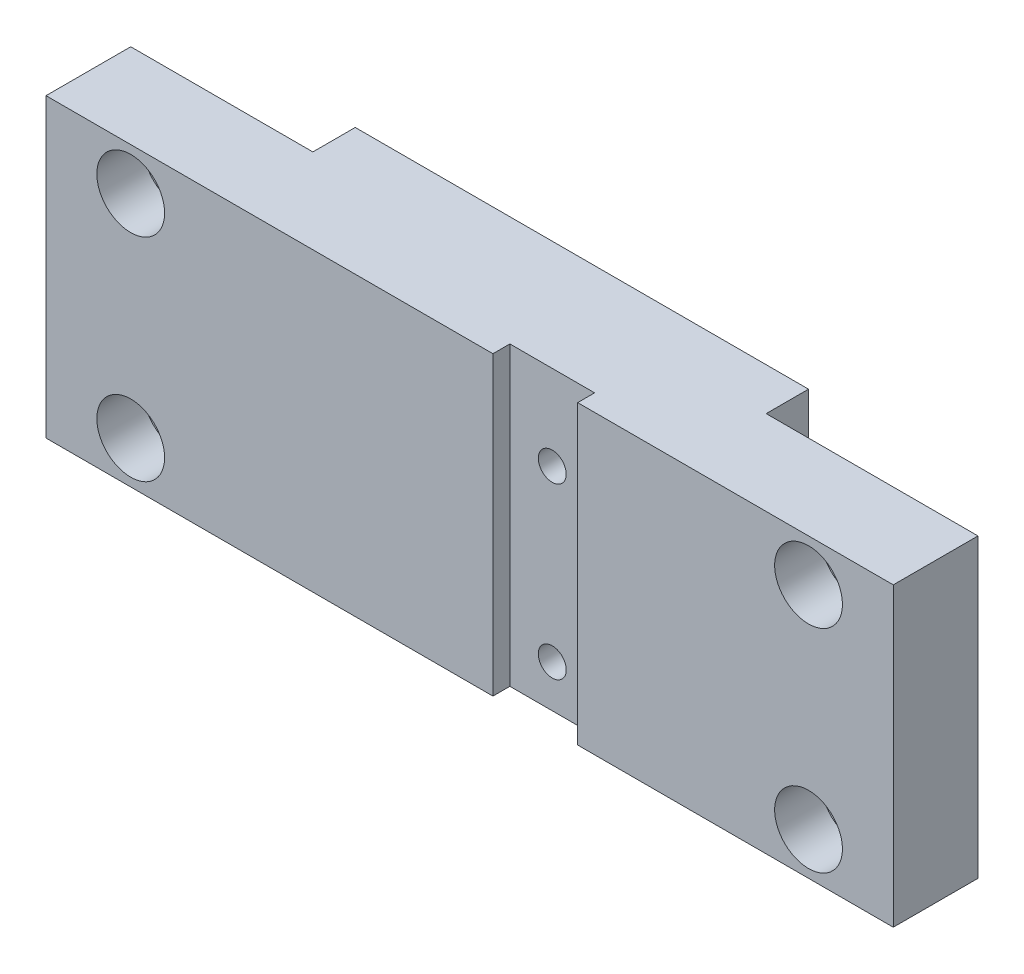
ISO-10303-21;
HEADER;
FILE_DESCRIPTION(('STEP AP214'),'2;1');
FILE_NAME('part.step','',(''),(''),'','','');
FILE_SCHEMA(('AUTOMOTIVE_DESIGN { 1 0 10303 214 1 1 1 1 }'));
ENDSEC;
DATA;
#1=APPLICATION_CONTEXT('core data for automotive mechanical design processes');
#2=APPLICATION_PROTOCOL_DEFINITION('international standard','automotive_design',2000,#1);
#3=PRODUCT_CONTEXT('',#1,'mechanical');
#4=PRODUCT('Part','Part','',(#3));
#5=PRODUCT_RELATED_PRODUCT_CATEGORY('part','',(#4));
#6=PRODUCT_DEFINITION_FORMATION('','',#4);
#7=PRODUCT_DEFINITION_CONTEXT('part definition',#1,'design');
#8=PRODUCT_DEFINITION('design','',#6,#7);
#9=PRODUCT_DEFINITION_SHAPE('','',#8);
#10=(LENGTH_UNIT() NAMED_UNIT(*) SI_UNIT(.MILLI.,.METRE.));
#11=(NAMED_UNIT(*) PLANE_ANGLE_UNIT() SI_UNIT($,.RADIAN.));
#12=(NAMED_UNIT(*) SI_UNIT($,.STERADIAN.) SOLID_ANGLE_UNIT());
#13=UNCERTAINTY_MEASURE_WITH_UNIT(LENGTH_MEASURE(1.E-05),#10,'distance_accuracy_value','');
#14=(GEOMETRIC_REPRESENTATION_CONTEXT(3) GLOBAL_UNCERTAINTY_ASSIGNED_CONTEXT((#13)) GLOBAL_UNIT_ASSIGNED_CONTEXT((#10,
#11,#12)) REPRESENTATION_CONTEXT('',''));
#15=CARTESIAN_POINT('',(0.,0.,0.));
#16=DIRECTION('',(0.,0.,1.));
#17=DIRECTION('',(1.,0.,0.));
#18=AXIS2_PLACEMENT_3D('',#15,#16,#17);
#19=CARTESIAN_POINT('',(10.,5.,15.));
#20=DIRECTION('',(0.,0.,-1.));
#21=DIRECTION('',(-1.,0.,0.));
#22=AXIS2_PLACEMENT_3D('',#19,#20,#21);
#23=CYLINDRICAL_SURFACE('',#22,2.25);
#24=CARTESIAN_POINT('',(10.,5.,5.00000000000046));
#25=DIRECTION('',(0.,0.,-1.));
#26=DIRECTION('',(-1.,0.,0.));
#27=AXIS2_PLACEMENT_3D('',#24,#25,#26);
#28=CIRCLE('',#27,2.25);
#29=CARTESIAN_POINT('',(7.75,5.,5.00000000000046));
#30=VERTEX_POINT('',#29);
#31=EDGE_CURVE('E199',#30,#30,#28,.T.);
#32=ORIENTED_EDGE('',*,*,#31,.T.);
#33=EDGE_LOOP('',(#32));
#34=FACE_BOUND('',#33,.T.);
#35=CARTESIAN_POINT('',(10.,5.,9.5));
#36=DIRECTION('',(0.,0.,1.));
#37=DIRECTION('',(1.,0.,0.));
#38=AXIS2_PLACEMENT_3D('',#35,#36,#37);
#39=CIRCLE('',#38,2.25);
#40=CARTESIAN_POINT('',(12.25,5.,9.5));
#41=VERTEX_POINT('',#40);
#42=EDGE_CURVE('E37',#41,#41,#39,.T.);
#43=ORIENTED_EDGE('',*,*,#42,.T.);
#44=EDGE_LOOP('',(#43));
#45=FACE_BOUND('',#44,.T.);
#46=ADVANCED_FACE('F33',(#34,#45),#23,.F.);
#47=CARTESIAN_POINT('',(90.,5.,15.));
#48=DIRECTION('',(0.,0.,-1.));
#49=DIRECTION('',(-1.,0.,0.));
#50=AXIS2_PLACEMENT_3D('',#47,#48,#49);
#51=CYLINDRICAL_SURFACE('',#50,2.25);
#52=CARTESIAN_POINT('',(90.,5.,5.00000000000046));
#53=DIRECTION('',(0.,0.,-1.));
#54=DIRECTION('',(-1.,0.,0.));
#55=AXIS2_PLACEMENT_3D('',#52,#53,#54);
#56=CIRCLE('',#55,2.25);
#57=CARTESIAN_POINT('',(87.75,5.,5.00000000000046));
#58=VERTEX_POINT('',#57);
#59=EDGE_CURVE('E203',#58,#58,#56,.T.);
#60=ORIENTED_EDGE('',*,*,#59,.T.);
#61=EDGE_LOOP('',(#60));
#62=FACE_BOUND('',#61,.T.);
#63=CARTESIAN_POINT('',(90.,5.,9.5));
#64=DIRECTION('',(0.,0.,1.));
#65=DIRECTION('',(1.,0.,0.));
#66=AXIS2_PLACEMENT_3D('',#63,#64,#65);
#67=CIRCLE('',#66,2.25);
#68=CARTESIAN_POINT('',(92.25,5.,9.5));
#69=VERTEX_POINT('',#68);
#70=EDGE_CURVE('E252',#69,#69,#67,.T.);
#71=ORIENTED_EDGE('',*,*,#70,.T.);
#72=EDGE_LOOP('',(#71));
#73=FACE_BOUND('',#72,.T.);
#74=ADVANCED_FACE('F323',(#62,#73),#51,.F.);
#75=CARTESIAN_POINT('',(90.,30.,15.));
#76=DIRECTION('',(0.,0.,-1.));
#77=DIRECTION('',(-1.,0.,0.));
#78=AXIS2_PLACEMENT_3D('',#75,#76,#77);
#79=CYLINDRICAL_SURFACE('',#78,2.25);
#80=CARTESIAN_POINT('',(90.,30.,5.00000000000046));
#81=DIRECTION('',(0.,0.,-1.));
#82=DIRECTION('',(-1.,0.,0.));
#83=AXIS2_PLACEMENT_3D('',#80,#81,#82);
#84=CIRCLE('',#83,2.25);
#85=CARTESIAN_POINT('',(87.75,30.,5.00000000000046));
#86=VERTEX_POINT('',#85);
#87=EDGE_CURVE('E204',#86,#86,#84,.T.);
#88=ORIENTED_EDGE('',*,*,#87,.T.);
#89=EDGE_LOOP('',(#88));
#90=FACE_BOUND('',#89,.T.);
#91=CARTESIAN_POINT('',(90.,30.,9.5));
#92=DIRECTION('',(0.,0.,1.));
#93=DIRECTION('',(1.,0.,0.));
#94=AXIS2_PLACEMENT_3D('',#91,#92,#93);
#95=CIRCLE('',#94,2.25);
#96=CARTESIAN_POINT('',(92.25,30.,9.5));
#97=VERTEX_POINT('',#96);
#98=EDGE_CURVE('E248',#97,#97,#95,.T.);
#99=ORIENTED_EDGE('',*,*,#98,.T.);
#100=EDGE_LOOP('',(#99));
#101=FACE_BOUND('',#100,.T.);
#102=ADVANCED_FACE('F329',(#90,#101),#79,.F.);
#103=CARTESIAN_POINT('',(10.,30.,15.));
#104=DIRECTION('',(0.,0.,-1.));
#105=DIRECTION('',(-1.,0.,0.));
#106=AXIS2_PLACEMENT_3D('',#103,#104,#105);
#107=CYLINDRICAL_SURFACE('',#106,2.25);
#108=CARTESIAN_POINT('',(10.,30.,5.00000000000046));
#109=DIRECTION('',(0.,0.,-1.));
#110=DIRECTION('',(-1.,0.,0.));
#111=AXIS2_PLACEMENT_3D('',#108,#109,#110);
#112=CIRCLE('',#111,2.25);
#113=CARTESIAN_POINT('',(7.75,30.,5.00000000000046));
#114=VERTEX_POINT('',#113);
#115=EDGE_CURVE('E200',#114,#114,#112,.T.);
#116=ORIENTED_EDGE('',*,*,#115,.T.);
#117=EDGE_LOOP('',(#116));
#118=FACE_BOUND('',#117,.T.);
#119=CARTESIAN_POINT('',(10.,30.,9.5));
#120=DIRECTION('',(0.,0.,1.));
#121=DIRECTION('',(1.,0.,0.));
#122=AXIS2_PLACEMENT_3D('',#119,#120,#121);
#123=CIRCLE('',#122,2.25);
#124=CARTESIAN_POINT('',(12.25,30.,9.5));
#125=VERTEX_POINT('',#124);
#126=EDGE_CURVE('E164',#125,#125,#123,.T.);
#127=ORIENTED_EDGE('',*,*,#126,.T.);
#128=EDGE_LOOP('',(#127));
#129=FACE_BOUND('',#128,.T.);
#130=ADVANCED_FACE('F339',(#118,#129),#107,.F.);
#131=CARTESIAN_POINT('',(0.,35.,15.));
#132=DIRECTION('',(0.,0.,-1.));
#133=DIRECTION('',(-1.,0.,0.));
#134=AXIS2_PLACEMENT_3D('',#131,#132,#133);
#135=PLANE('',#134);
#136=CARTESIAN_POINT('',(90.,5.,15.));
#137=DIRECTION('',(0.,0.,1.));
#138=DIRECTION('',(1.,0.,0.));
#139=AXIS2_PLACEMENT_3D('',#136,#137,#138);
#140=CIRCLE('',#139,4.);
#141=CARTESIAN_POINT('',(94.,5.,15.));
#142=VERTEX_POINT('',#141);
#143=EDGE_CURVE('E261',#142,#142,#140,.T.);
#144=ORIENTED_EDGE('',*,*,#143,.F.);
#145=EDGE_LOOP('',(#144));
#146=FACE_BOUND('',#145,.T.);
#147=CARTESIAN_POINT('',(90.,30.,15.));
#148=DIRECTION('',(0.,0.,1.));
#149=DIRECTION('',(1.,0.,0.));
#150=AXIS2_PLACEMENT_3D('',#147,#148,#149);
#151=CIRCLE('',#150,4.);
#152=CARTESIAN_POINT('',(94.,30.,15.));
#153=VERTEX_POINT('',#152);
#154=EDGE_CURVE('E254',#153,#153,#151,.T.);
#155=ORIENTED_EDGE('',*,*,#154,.F.);
#156=EDGE_LOOP('',(#155));
#157=FACE_BOUND('',#156,.T.);
#158=DIRECTION('',(0.,1.,0.));
#159=VECTOR('',#158,1.);
#160=CARTESIAN_POINT('',(62.7500000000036,0.,15.0000000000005));
#161=LINE('',#160,#159);
#162=CARTESIAN_POINT('',(62.7500000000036,0.,15.0000000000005));
#163=VERTEX_POINT('',#162);
#164=CARTESIAN_POINT('',(62.7500000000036,35.,15.0000000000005));
#165=VERTEX_POINT('',#164);
#166=EDGE_CURVE('E192',#163,#165,#161,.T.);
#167=ORIENTED_EDGE('',*,*,#166,.F.);
#168=DIRECTION('',(1.,0.,0.));
#169=VECTOR('',#168,1.);
#170=CARTESIAN_POINT('',(0.,0.,15.));
#171=LINE('',#170,#169);
#172=CARTESIAN_POINT('',(100.,0.,15.));
#173=VERTEX_POINT('',#172);
#174=EDGE_CURVE('E217',#163,#173,#171,.T.);
#175=ORIENTED_EDGE('',*,*,#174,.T.);
#176=DIRECTION('',(0.,1.,0.));
#177=VECTOR('',#176,1.);
#178=CARTESIAN_POINT('',(100.,0.,15.));
#179=LINE('',#178,#177);
#180=CARTESIAN_POINT('',(100.,35.,15.));
#181=VERTEX_POINT('',#180);
#182=EDGE_CURVE('E221',#173,#181,#179,.T.);
#183=ORIENTED_EDGE('',*,*,#182,.T.);
#184=DIRECTION('',(-1.,0.,0.));
#185=VECTOR('',#184,1.);
#186=CARTESIAN_POINT('',(0.,35.,15.));
#187=LINE('',#186,#185);
#188=EDGE_CURVE('E224',#181,#165,#187,.T.);
#189=ORIENTED_EDGE('',*,*,#188,.T.);
#190=EDGE_LOOP('',(#167,#175,#183,#189));
#191=FACE_BOUND('',#190,.T.);
#192=ADVANCED_FACE('F283',(#146,#157,#191),#135,.F.);
#193=CARTESIAN_POINT('',(10.,5.,15.));
#194=DIRECTION('',(0.,0.,1.));
#195=DIRECTION('',(1.,0.,0.));
#196=AXIS2_PLACEMENT_3D('',#193,#194,#195);
#197=CIRCLE('',#196,4.);
#198=CARTESIAN_POINT('',(14.,5.,15.));
#199=VERTEX_POINT('',#198);
#200=EDGE_CURVE('E268',#199,#199,#197,.T.);
#201=ORIENTED_EDGE('',*,*,#200,.F.);
#202=EDGE_LOOP('',(#201));
#203=FACE_BOUND('',#202,.T.);
#204=CARTESIAN_POINT('',(10.,30.,15.));
#205=DIRECTION('',(0.,0.,1.));
#206=DIRECTION('',(1.,0.,0.));
#207=AXIS2_PLACEMENT_3D('',#204,#205,#206);
#208=CIRCLE('',#207,4.);
#209=CARTESIAN_POINT('',(14.,30.,15.));
#210=VERTEX_POINT('',#209);
#211=EDGE_CURVE('E250',#210,#210,#208,.T.);
#212=ORIENTED_EDGE('',*,*,#211,.F.);
#213=EDGE_LOOP('',(#212));
#214=FACE_BOUND('',#213,.T.);
#215=DIRECTION('',(0.,1.,0.));
#216=VECTOR('',#215,1.);
#217=CARTESIAN_POINT('',(52.7500000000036,0.,15.0000000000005));
#218=LINE('',#217,#216);
#219=CARTESIAN_POINT('',(52.7500000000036,0.,15.0000000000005));
#220=VERTEX_POINT('',#219);
#221=CARTESIAN_POINT('',(52.7500000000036,35.,15.0000000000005));
#222=VERTEX_POINT('',#221);
#223=EDGE_CURVE('E135',#220,#222,#218,.T.);
#224=ORIENTED_EDGE('',*,*,#223,.T.);
#225=CARTESIAN_POINT('',(0.,35.,15.));
#226=VERTEX_POINT('',#225);
#227=EDGE_CURVE('E223',#222,#226,#187,.T.);
#228=ORIENTED_EDGE('',*,*,#227,.T.);
#229=DIRECTION('',(0.,-1.,0.));
#230=VECTOR('',#229,1.);
#231=CARTESIAN_POINT('',(0.,0.,15.));
#232=LINE('',#231,#230);
#233=CARTESIAN_POINT('',(0.,0.,15.));
#234=VERTEX_POINT('',#233);
#235=EDGE_CURVE('E214',#226,#234,#232,.T.);
#236=ORIENTED_EDGE('',*,*,#235,.T.);
#237=EDGE_CURVE('E219',#234,#220,#171,.T.);
#238=ORIENTED_EDGE('',*,*,#237,.T.);
#239=EDGE_LOOP('',(#224,#228,#236,#238));
#240=FACE_BOUND('',#239,.T.);
#241=ADVANCED_FACE('F279',(#203,#214,#240),#135,.F.);
#242=CARTESIAN_POINT('',(0.,35.,0.));
#243=DIRECTION('',(0.,0.,-1.));
#244=DIRECTION('',(-1.,0.,0.));
#245=AXIS2_PLACEMENT_3D('',#242,#243,#244);
#246=PLANE('',#245);
#247=CARTESIAN_POINT('',(57.75,25.,0.));
#248=DIRECTION('',(0.,0.,1.));
#249=DIRECTION('',(1.,0.,0.));
#250=AXIS2_PLACEMENT_3D('',#247,#248,#249);
#251=CIRCLE('',#250,1.65);
#252=CARTESIAN_POINT('',(59.4,25.,0.));
#253=VERTEX_POINT('',#252);
#254=EDGE_CURVE('E210',#253,#253,#251,.T.);
#255=ORIENTED_EDGE('',*,*,#254,.T.);
#256=EDGE_LOOP('',(#255));
#257=FACE_BOUND('',#256,.T.);
#258=CARTESIAN_POINT('',(57.75,5.,0.));
#259=DIRECTION('',(0.,0.,1.));
#260=DIRECTION('',(1.,0.,0.));
#261=AXIS2_PLACEMENT_3D('',#258,#259,#260);
#262=CIRCLE('',#261,1.65);
#263=CARTESIAN_POINT('',(59.4,5.,0.));
#264=VERTEX_POINT('',#263);
#265=EDGE_CURVE('E207',#264,#264,#262,.T.);
#266=ORIENTED_EDGE('',*,*,#265,.T.);
#267=EDGE_LOOP('',(#266));
#268=FACE_BOUND('',#267,.T.);
#269=DIRECTION('',(1.,0.,0.));
#270=VECTOR('',#269,1.);
#271=CARTESIAN_POINT('',(0.,0.,0.));
#272=LINE('',#271,#270);
#273=CARTESIAN_POINT('',(21.4975000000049,0.,4.54747350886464E-13));
#274=VERTEX_POINT('',#273);
#275=CARTESIAN_POINT('',(74.9975000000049,0.,4.54747350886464E-13));
#276=VERTEX_POINT('',#275);
#277=EDGE_CURVE('E213',#274,#276,#272,.T.);
#278=ORIENTED_EDGE('',*,*,#277,.F.);
#279=DIRECTION('',(0.,1.,0.));
#280=VECTOR('',#279,1.);
#281=CARTESIAN_POINT('',(21.4975000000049,0.,4.54747350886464E-13));
#282=LINE('',#281,#280);
#283=CARTESIAN_POINT('',(21.4975000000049,35.,4.54747350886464E-13));
#284=VERTEX_POINT('',#283);
#285=EDGE_CURVE('E182',#274,#284,#282,.T.);
#286=ORIENTED_EDGE('',*,*,#285,.T.);
#287=DIRECTION('',(-1.,0.,0.));
#288=VECTOR('',#287,1.);
#289=CARTESIAN_POINT('',(0.,35.,0.));
#290=LINE('',#289,#288);
#291=CARTESIAN_POINT('',(74.9975000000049,35.,4.54747350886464E-13));
#292=VERTEX_POINT('',#291);
#293=EDGE_CURVE('E218',#292,#284,#290,.T.);
#294=ORIENTED_EDGE('',*,*,#293,.F.);
#295=DIRECTION('',(0.,1.,0.));
#296=VECTOR('',#295,1.);
#297=CARTESIAN_POINT('',(74.9975000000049,0.,4.54747350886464E-13));
#298=LINE('',#297,#296);
#299=EDGE_CURVE('E185',#276,#292,#298,.T.);
#300=ORIENTED_EDGE('',*,*,#299,.F.);
#301=EDGE_LOOP('',(#278,#286,#294,#300));
#302=FACE_BOUND('',#301,.T.);
#303=ADVANCED_FACE('F282',(#257,#268,#302),#246,.T.);
#304=CARTESIAN_POINT('',(0.,0.,15.));
#305=DIRECTION('',(1.,0.,0.));
#306=DIRECTION('',(0.,0.,-1.));
#307=AXIS2_PLACEMENT_3D('',#304,#305,#306);
#308=PLANE('',#307);
#309=DIRECTION('',(0.,1.,0.));
#310=VECTOR('',#309,1.);
#311=CARTESIAN_POINT('',(3.63797880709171E-12,0.,5.00000000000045));
#312=LINE('',#311,#310);
#313=CARTESIAN_POINT('',(3.63797880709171E-12,0.,5.00000000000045));
#314=VERTEX_POINT('',#313);
#315=CARTESIAN_POINT('',(3.63797880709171E-12,35.,5.00000000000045));
#316=VERTEX_POINT('',#315);
#317=EDGE_CURVE('E177',#314,#316,#312,.T.);
#318=ORIENTED_EDGE('',*,*,#317,.F.);
#319=DIRECTION('',(0.,0.,-1.));
#320=VECTOR('',#319,1.);
#321=CARTESIAN_POINT('',(0.,0.,15.));
#322=LINE('',#321,#320);
#323=EDGE_CURVE('E12',#234,#314,#322,.T.);
#324=ORIENTED_EDGE('',*,*,#323,.F.);
#325=ORIENTED_EDGE('',*,*,#235,.F.);
#326=DIRECTION('',(0.,0.,-1.));
#327=VECTOR('',#326,1.);
#328=CARTESIAN_POINT('',(0.,35.,15.));
#329=LINE('',#328,#327);
#330=EDGE_CURVE('E227',#226,#316,#329,.T.);
#331=ORIENTED_EDGE('',*,*,#330,.T.);
#332=EDGE_LOOP('',(#318,#324,#325,#331));
#333=FACE_BOUND('',#332,.T.);
#334=ADVANCED_FACE('F35',(#333),#308,.F.);
#335=CARTESIAN_POINT('',(0.,0.,15.));
#336=DIRECTION('',(0.,1.,0.));
#337=DIRECTION('',(0.,0.,1.));
#338=AXIS2_PLACEMENT_3D('',#335,#336,#337);
#339=PLANE('',#338);
#340=DIRECTION('',(-1.,0.,0.));
#341=VECTOR('',#340,1.);
#342=CARTESIAN_POINT('',(3.63797880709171E-12,0.,5.00000000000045));
#343=LINE('',#342,#341);
#344=CARTESIAN_POINT('',(21.4975000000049,0.,5.00000000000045));
#345=VERTEX_POINT('',#344);
#346=EDGE_CURVE('E160',#345,#314,#343,.T.);
#347=ORIENTED_EDGE('',*,*,#346,.F.);
#348=DIRECTION('',(0.,0.,1.));
#349=VECTOR('',#348,1.);
#350=CARTESIAN_POINT('',(21.4975000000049,0.,5.00000000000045));
#351=LINE('',#350,#349);
#352=EDGE_CURVE('E157',#274,#345,#351,.T.);
#353=ORIENTED_EDGE('',*,*,#352,.F.);
#354=ORIENTED_EDGE('',*,*,#277,.T.);
#355=DIRECTION('',(0.,0.,-1.));
#356=VECTOR('',#355,1.);
#357=CARTESIAN_POINT('',(74.9975000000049,0.,5.00000000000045));
#358=LINE('',#357,#356);
#359=CARTESIAN_POINT('',(74.9975000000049,0.,5.00000000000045));
#360=VERTEX_POINT('',#359);
#361=EDGE_CURVE('E155',#360,#276,#358,.T.);
#362=ORIENTED_EDGE('',*,*,#361,.F.);
#363=DIRECTION('',(-1.,0.,0.));
#364=VECTOR('',#363,1.);
#365=CARTESIAN_POINT('',(74.9975000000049,0.,5.00000000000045));
#366=LINE('',#365,#364);
#367=CARTESIAN_POINT('',(100.000000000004,0.,5.00000000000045));
#368=VERTEX_POINT('',#367);
#369=EDGE_CURVE('E149',#368,#360,#366,.T.);
#370=ORIENTED_EDGE('',*,*,#369,.F.);
#371=DIRECTION('',(0.,0.,-1.));
#372=VECTOR('',#371,1.);
#373=CARTESIAN_POINT('',(100.,0.,15.));
#374=LINE('',#373,#372);
#375=EDGE_CURVE('E42',#173,#368,#374,.T.);
#376=ORIENTED_EDGE('',*,*,#375,.F.);
#377=ORIENTED_EDGE('',*,*,#174,.F.);
#378=DIRECTION('',(0.,0.,1.));
#379=VECTOR('',#378,1.);
#380=CARTESIAN_POINT('',(62.7500000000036,0.,15.0000000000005));
#381=LINE('',#380,#379);
#382=CARTESIAN_POINT('',(62.7500000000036,0.,13.0000000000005));
#383=VERTEX_POINT('',#382);
#384=EDGE_CURVE('E147',#383,#163,#381,.T.);
#385=ORIENTED_EDGE('',*,*,#384,.F.);
#386=DIRECTION('',(1.,0.,0.));
#387=VECTOR('',#386,1.);
#388=CARTESIAN_POINT('',(52.7500000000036,0.,13.0000000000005));
#389=LINE('',#388,#387);
#390=CARTESIAN_POINT('',(52.7500000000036,0.,13.0000000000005));
#391=VERTEX_POINT('',#390);
#392=EDGE_CURVE('E128',#391,#383,#389,.T.);
#393=ORIENTED_EDGE('',*,*,#392,.F.);
#394=DIRECTION('',(0.,0.,-1.));
#395=VECTOR('',#394,1.);
#396=CARTESIAN_POINT('',(52.7500000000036,0.,15.0000000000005));
#397=LINE('',#396,#395);
#398=EDGE_CURVE('E138',#220,#391,#397,.T.);
#399=ORIENTED_EDGE('',*,*,#398,.F.);
#400=ORIENTED_EDGE('',*,*,#237,.F.);
#401=ORIENTED_EDGE('',*,*,#323,.T.);
#402=EDGE_LOOP('',(#347,#353,#354,#362,#370,#376,#377,#385,#393,#399,#400,#401));
#403=FACE_BOUND('',#402,.T.);
#404=ADVANCED_FACE('F145',(#403),#339,.F.);
#405=CARTESIAN_POINT('',(100.,0.,15.));
#406=DIRECTION('',(-1.,0.,0.));
#407=DIRECTION('',(0.,0.,1.));
#408=AXIS2_PLACEMENT_3D('',#405,#406,#407);
#409=PLANE('',#408);
#410=DIRECTION('',(0.,1.,0.));
#411=VECTOR('',#410,1.);
#412=CARTESIAN_POINT('',(100.000000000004,0.,5.00000000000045));
#413=LINE('',#412,#411);
#414=CARTESIAN_POINT('',(100.000000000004,35.,5.00000000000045));
#415=VERTEX_POINT('',#414);
#416=EDGE_CURVE('E189',#368,#415,#413,.T.);
#417=ORIENTED_EDGE('',*,*,#416,.T.);
#418=DIRECTION('',(0.,0.,-1.));
#419=VECTOR('',#418,1.);
#420=CARTESIAN_POINT('',(100.,35.,15.));
#421=LINE('',#420,#419);
#422=EDGE_CURVE('E234',#181,#415,#421,.T.);
#423=ORIENTED_EDGE('',*,*,#422,.F.);
#424=ORIENTED_EDGE('',*,*,#182,.F.);
#425=ORIENTED_EDGE('',*,*,#375,.T.);
#426=EDGE_LOOP('',(#417,#423,#424,#425));
#427=FACE_BOUND('',#426,.T.);
#428=ADVANCED_FACE('F308',(#427),#409,.F.);
#429=CARTESIAN_POINT('',(0.,35.,15.));
#430=DIRECTION('',(0.,-1.,0.));
#431=DIRECTION('',(0.,0.,-1.));
#432=AXIS2_PLACEMENT_3D('',#429,#430,#431);
#433=PLANE('',#432);
#434=DIRECTION('',(-1.,0.,0.));
#435=VECTOR('',#434,1.);
#436=CARTESIAN_POINT('',(3.63797880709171E-12,35.,5.00000000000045));
#437=LINE('',#436,#435);
#438=CARTESIAN_POINT('',(21.4975000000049,35.,5.00000000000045));
#439=VERTEX_POINT('',#438);
#440=EDGE_CURVE('E50',#439,#316,#437,.T.);
#441=ORIENTED_EDGE('',*,*,#440,.T.);
#442=ORIENTED_EDGE('',*,*,#330,.F.);
#443=ORIENTED_EDGE('',*,*,#227,.F.);
#444=DIRECTION('',(0.,0.,-1.));
#445=VECTOR('',#444,1.);
#446=CARTESIAN_POINT('',(52.7500000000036,35.,15.0000000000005));
#447=LINE('',#446,#445);
#448=CARTESIAN_POINT('',(52.7500000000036,35.,13.0000000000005));
#449=VERTEX_POINT('',#448);
#450=EDGE_CURVE('E162',#222,#449,#447,.T.);
#451=ORIENTED_EDGE('',*,*,#450,.T.);
#452=DIRECTION('',(1.,0.,0.));
#453=VECTOR('',#452,1.);
#454=CARTESIAN_POINT('',(52.7500000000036,35.,13.0000000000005));
#455=LINE('',#454,#453);
#456=CARTESIAN_POINT('',(62.7500000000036,35.,13.0000000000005));
#457=VERTEX_POINT('',#456);
#458=EDGE_CURVE('E131',#449,#457,#455,.T.);
#459=ORIENTED_EDGE('',*,*,#458,.T.);
#460=DIRECTION('',(0.,0.,1.));
#461=VECTOR('',#460,1.);
#462=CARTESIAN_POINT('',(62.7500000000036,35.,15.0000000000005));
#463=LINE('',#462,#461);
#464=EDGE_CURVE('E166',#457,#165,#463,.T.);
#465=ORIENTED_EDGE('',*,*,#464,.T.);
#466=ORIENTED_EDGE('',*,*,#188,.F.);
#467=ORIENTED_EDGE('',*,*,#422,.T.);
#468=DIRECTION('',(-1.,0.,0.));
#469=VECTOR('',#468,1.);
#470=CARTESIAN_POINT('',(74.9975000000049,35.,5.00000000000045));
#471=LINE('',#470,#469);
#472=CARTESIAN_POINT('',(74.9975000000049,35.,5.00000000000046));
#473=VERTEX_POINT('',#472);
#474=EDGE_CURVE('E169',#415,#473,#471,.T.);
#475=ORIENTED_EDGE('',*,*,#474,.T.);
#476=DIRECTION('',(0.,0.,-1.));
#477=VECTOR('',#476,1.);
#478=CARTESIAN_POINT('',(74.9975000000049,35.,5.00000000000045));
#479=LINE('',#478,#477);
#480=EDGE_CURVE('E58',#473,#292,#479,.T.);
#481=ORIENTED_EDGE('',*,*,#480,.T.);
#482=ORIENTED_EDGE('',*,*,#293,.T.);
#483=DIRECTION('',(0.,0.,1.));
#484=VECTOR('',#483,1.);
#485=CARTESIAN_POINT('',(21.4975000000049,35.,5.00000000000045));
#486=LINE('',#485,#484);
#487=EDGE_CURVE('E173',#284,#439,#486,.T.);
#488=ORIENTED_EDGE('',*,*,#487,.T.);
#489=EDGE_LOOP('',(#441,#442,#443,#451,#459,#465,#466,#467,#475,#481,#482,#488));
#490=FACE_BOUND('',#489,.T.);
#491=ADVANCED_FACE('F289',(#490),#433,.F.);
#492=CARTESIAN_POINT('',(57.75,25.,15.));
#493=DIRECTION('',(0.,0.,-1.));
#494=DIRECTION('',(-1.,0.,0.));
#495=AXIS2_PLACEMENT_3D('',#492,#493,#494);
#496=CYLINDRICAL_SURFACE('',#495,1.65);
#497=ORIENTED_EDGE('',*,*,#254,.F.);
#498=EDGE_LOOP('',(#497));
#499=FACE_BOUND('',#498,.T.);
#500=CARTESIAN_POINT('',(57.75,25.,13.0000000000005));
#501=DIRECTION('',(0.,0.,1.));
#502=DIRECTION('',(1.,0.,0.));
#503=AXIS2_PLACEMENT_3D('',#500,#501,#502);
#504=CIRCLE('',#503,1.65);
#505=CARTESIAN_POINT('',(59.4,25.,13.0000000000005));
#506=VERTEX_POINT('',#505);
#507=EDGE_CURVE('E196',#506,#506,#504,.T.);
#508=ORIENTED_EDGE('',*,*,#507,.T.);
#509=EDGE_LOOP('',(#508));
#510=FACE_BOUND('',#509,.T.);
#511=ADVANCED_FACE('F334',(#499,#510),#496,.F.);
#512=CARTESIAN_POINT('',(57.75,5.,15.));
#513=DIRECTION('',(0.,0.,-1.));
#514=DIRECTION('',(-1.,0.,0.));
#515=AXIS2_PLACEMENT_3D('',#512,#513,#514);
#516=CYLINDRICAL_SURFACE('',#515,1.65);
#517=ORIENTED_EDGE('',*,*,#265,.F.);
#518=EDGE_LOOP('',(#517));
#519=FACE_BOUND('',#518,.T.);
#520=CARTESIAN_POINT('',(57.75,5.,13.0000000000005));
#521=DIRECTION('',(0.,0.,1.));
#522=DIRECTION('',(1.,0.,0.));
#523=AXIS2_PLACEMENT_3D('',#520,#521,#522);
#524=CIRCLE('',#523,1.65);
#525=CARTESIAN_POINT('',(59.4,5.,13.0000000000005));
#526=VERTEX_POINT('',#525);
#527=EDGE_CURVE('E179',#526,#526,#524,.T.);
#528=ORIENTED_EDGE('',*,*,#527,.T.);
#529=EDGE_LOOP('',(#528));
#530=FACE_BOUND('',#529,.T.);
#531=ADVANCED_FACE('F441',(#519,#530),#516,.F.);
#532=CARTESIAN_POINT('',(52.7500000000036,0.,13.0000000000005));
#533=DIRECTION('',(0.,0.,1.));
#534=DIRECTION('',(1.,0.,0.));
#535=AXIS2_PLACEMENT_3D('',#532,#533,#534);
#536=PLANE('',#535);
#537=ORIENTED_EDGE('',*,*,#507,.F.);
#538=EDGE_LOOP('',(#537));
#539=FACE_BOUND('',#538,.T.);
#540=ORIENTED_EDGE('',*,*,#527,.F.);
#541=EDGE_LOOP('',(#540));
#542=FACE_BOUND('',#541,.T.);
#543=ORIENTED_EDGE('',*,*,#458,.F.);
#544=DIRECTION('',(0.,1.,0.));
#545=VECTOR('',#544,1.);
#546=CARTESIAN_POINT('',(52.7500000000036,0.,13.0000000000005));
#547=LINE('',#546,#545);
#548=EDGE_CURVE('E124',#391,#449,#547,.T.);
#549=ORIENTED_EDGE('',*,*,#548,.F.);
#550=ORIENTED_EDGE('',*,*,#392,.T.);
#551=DIRECTION('',(0.,1.,0.));
#552=VECTOR('',#551,1.);
#553=CARTESIAN_POINT('',(62.7500000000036,0.,13.0000000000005));
#554=LINE('',#553,#552);
#555=EDGE_CURVE('E134',#383,#457,#554,.T.);
#556=ORIENTED_EDGE('',*,*,#555,.T.);
#557=EDGE_LOOP('',(#543,#549,#550,#556));
#558=FACE_BOUND('',#557,.T.);
#559=ADVANCED_FACE('F126',(#539,#542,#558),#536,.T.);
#560=CARTESIAN_POINT('',(52.7500000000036,0.,15.0000000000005));
#561=DIRECTION('',(1.,0.,0.));
#562=DIRECTION('',(0.,0.,-1.));
#563=AXIS2_PLACEMENT_3D('',#560,#561,#562);
#564=PLANE('',#563);
#565=ORIENTED_EDGE('',*,*,#450,.F.);
#566=ORIENTED_EDGE('',*,*,#223,.F.);
#567=ORIENTED_EDGE('',*,*,#398,.T.);
#568=ORIENTED_EDGE('',*,*,#548,.T.);
#569=EDGE_LOOP('',(#565,#566,#567,#568));
#570=FACE_BOUND('',#569,.T.);
#571=ADVANCED_FACE('F139',(#570),#564,.T.);
#572=CARTESIAN_POINT('',(62.7500000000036,0.,15.0000000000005));
#573=DIRECTION('',(-1.,0.,0.));
#574=DIRECTION('',(0.,0.,1.));
#575=AXIS2_PLACEMENT_3D('',#572,#573,#574);
#576=PLANE('',#575);
#577=ORIENTED_EDGE('',*,*,#464,.F.);
#578=ORIENTED_EDGE('',*,*,#555,.F.);
#579=ORIENTED_EDGE('',*,*,#384,.T.);
#580=ORIENTED_EDGE('',*,*,#166,.T.);
#581=EDGE_LOOP('',(#577,#578,#579,#580));
#582=FACE_BOUND('',#581,.T.);
#583=ADVANCED_FACE('F414',(#582),#576,.T.);
#584=CARTESIAN_POINT('',(3.63797880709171E-12,0.,5.00000000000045));
#585=DIRECTION('',(0.,0.,-1.));
#586=DIRECTION('',(-1.,0.,0.));
#587=AXIS2_PLACEMENT_3D('',#584,#585,#586);
#588=PLANE('',#587);
#589=ORIENTED_EDGE('',*,*,#115,.F.);
#590=EDGE_LOOP('',(#589));
#591=FACE_BOUND('',#590,.T.);
#592=ORIENTED_EDGE('',*,*,#31,.F.);
#593=EDGE_LOOP('',(#592));
#594=FACE_BOUND('',#593,.T.);
#595=ORIENTED_EDGE('',*,*,#440,.F.);
#596=DIRECTION('',(0.,1.,0.));
#597=VECTOR('',#596,1.);
#598=CARTESIAN_POINT('',(21.4975000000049,0.,5.00000000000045));
#599=LINE('',#598,#597);
#600=EDGE_CURVE('E180',#345,#439,#599,.T.);
#601=ORIENTED_EDGE('',*,*,#600,.F.);
#602=ORIENTED_EDGE('',*,*,#346,.T.);
#603=ORIENTED_EDGE('',*,*,#317,.T.);
#604=EDGE_LOOP('',(#595,#601,#602,#603));
#605=FACE_BOUND('',#604,.T.);
#606=ADVANCED_FACE('F296',(#591,#594,#605),#588,.T.);
#607=CARTESIAN_POINT('',(21.4975000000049,0.,5.00000000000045));
#608=DIRECTION('',(-1.,0.,0.));
#609=DIRECTION('',(0.,0.,1.));
#610=AXIS2_PLACEMENT_3D('',#607,#608,#609);
#611=PLANE('',#610);
#612=ORIENTED_EDGE('',*,*,#487,.F.);
#613=ORIENTED_EDGE('',*,*,#285,.F.);
#614=ORIENTED_EDGE('',*,*,#352,.T.);
#615=ORIENTED_EDGE('',*,*,#600,.T.);
#616=EDGE_LOOP('',(#612,#613,#614,#615));
#617=FACE_BOUND('',#616,.T.);
#618=ADVANCED_FACE('F298',(#617),#611,.T.);
#619=CARTESIAN_POINT('',(74.9975000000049,0.,5.00000000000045));
#620=DIRECTION('',(1.,0.,0.));
#621=DIRECTION('',(0.,0.,-1.));
#622=AXIS2_PLACEMENT_3D('',#619,#620,#621);
#623=PLANE('',#622);
#624=ORIENTED_EDGE('',*,*,#480,.F.);
#625=DIRECTION('',(0.,1.,0.));
#626=VECTOR('',#625,1.);
#627=CARTESIAN_POINT('',(74.9975000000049,0.,5.00000000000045));
#628=LINE('',#627,#626);
#629=EDGE_CURVE('E187',#360,#473,#628,.T.);
#630=ORIENTED_EDGE('',*,*,#629,.F.);
#631=ORIENTED_EDGE('',*,*,#361,.T.);
#632=ORIENTED_EDGE('',*,*,#299,.T.);
#633=EDGE_LOOP('',(#624,#630,#631,#632));
#634=FACE_BOUND('',#633,.T.);
#635=ADVANCED_FACE('F312',(#634),#623,.T.);
#636=CARTESIAN_POINT('',(74.9975000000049,0.,5.00000000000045));
#637=DIRECTION('',(0.,0.,-1.));
#638=DIRECTION('',(-1.,0.,0.));
#639=AXIS2_PLACEMENT_3D('',#636,#637,#638);
#640=PLANE('',#639);
#641=ORIENTED_EDGE('',*,*,#87,.F.);
#642=EDGE_LOOP('',(#641));
#643=FACE_BOUND('',#642,.T.);
#644=ORIENTED_EDGE('',*,*,#59,.F.);
#645=EDGE_LOOP('',(#644));
#646=FACE_BOUND('',#645,.T.);
#647=ORIENTED_EDGE('',*,*,#474,.F.);
#648=ORIENTED_EDGE('',*,*,#416,.F.);
#649=ORIENTED_EDGE('',*,*,#369,.T.);
#650=ORIENTED_EDGE('',*,*,#629,.T.);
#651=EDGE_LOOP('',(#647,#648,#649,#650));
#652=FACE_BOUND('',#651,.T.);
#653=ADVANCED_FACE('F305',(#643,#646,#652),#640,.T.);
#654=CARTESIAN_POINT('',(10.,30.,9.5));
#655=DIRECTION('',(0.,0.,1.));
#656=DIRECTION('',(1.,0.,0.));
#657=AXIS2_PLACEMENT_3D('',#654,#655,#656);
#658=CYLINDRICAL_SURFACE('',#657,4.);
#659=CARTESIAN_POINT('',(10.,30.,9.5));
#660=DIRECTION('',(0.,0.,1.));
#661=DIRECTION('',(1.,0.,0.));
#662=AXIS2_PLACEMENT_3D('',#659,#660,#661);
#663=CIRCLE('',#662,4.);
#664=CARTESIAN_POINT('',(14.,30.,9.5));
#665=VERTEX_POINT('',#664);
#666=EDGE_CURVE('E247',#665,#665,#663,.T.);
#667=ORIENTED_EDGE('',*,*,#666,.F.);
#668=EDGE_LOOP('',(#667));
#669=FACE_BOUND('',#668,.T.);
#670=ORIENTED_EDGE('',*,*,#211,.T.);
#671=EDGE_LOOP('',(#670));
#672=FACE_BOUND('',#671,.T.);
#673=ADVANCED_FACE('F277',(#669,#672),#658,.F.);
#674=CARTESIAN_POINT('',(10.,30.,9.5));
#675=DIRECTION('',(0.,0.,1.));
#676=DIRECTION('',(1.,0.,0.));
#677=AXIS2_PLACEMENT_3D('',#674,#675,#676);
#678=PLANE('',#677);
#679=ORIENTED_EDGE('',*,*,#126,.F.);
#680=EDGE_LOOP('',(#679));
#681=FACE_BOUND('',#680,.T.);
#682=ORIENTED_EDGE('',*,*,#666,.T.);
#683=EDGE_LOOP('',(#682));
#684=FACE_BOUND('',#683,.T.);
#685=ADVANCED_FACE('F501',(#681,#684),#678,.T.);
#686=CARTESIAN_POINT('',(90.,30.,9.5));
#687=DIRECTION('',(0.,0.,1.));
#688=DIRECTION('',(1.,0.,0.));
#689=AXIS2_PLACEMENT_3D('',#686,#687,#688);
#690=CYLINDRICAL_SURFACE('',#689,4.);
#691=CARTESIAN_POINT('',(90.,30.,9.5));
#692=DIRECTION('',(0.,0.,1.));
#693=DIRECTION('',(1.,0.,0.));
#694=AXIS2_PLACEMENT_3D('',#691,#692,#693);
#695=CIRCLE('',#694,4.);
#696=CARTESIAN_POINT('',(94.,30.,9.5));
#697=VERTEX_POINT('',#696);
#698=EDGE_CURVE('E251',#697,#697,#695,.T.);
#699=ORIENTED_EDGE('',*,*,#698,.F.);
#700=EDGE_LOOP('',(#699));
#701=FACE_BOUND('',#700,.T.);
#702=ORIENTED_EDGE('',*,*,#154,.T.);
#703=EDGE_LOOP('',(#702));
#704=FACE_BOUND('',#703,.T.);
#705=ADVANCED_FACE('F505',(#701,#704),#690,.F.);
#706=CARTESIAN_POINT('',(90.,30.,9.5));
#707=DIRECTION('',(0.,0.,1.));
#708=DIRECTION('',(1.,0.,0.));
#709=AXIS2_PLACEMENT_3D('',#706,#707,#708);
#710=PLANE('',#709);
#711=ORIENTED_EDGE('',*,*,#98,.F.);
#712=EDGE_LOOP('',(#711));
#713=FACE_BOUND('',#712,.T.);
#714=ORIENTED_EDGE('',*,*,#698,.T.);
#715=EDGE_LOOP('',(#714));
#716=FACE_BOUND('',#715,.T.);
#717=ADVANCED_FACE('F509',(#713,#716),#710,.T.);
#718=CARTESIAN_POINT('',(90.,5.,9.5));
#719=DIRECTION('',(0.,0.,1.));
#720=DIRECTION('',(1.,0.,0.));
#721=AXIS2_PLACEMENT_3D('',#718,#719,#720);
#722=CYLINDRICAL_SURFACE('',#721,4.);
#723=CARTESIAN_POINT('',(90.,5.,9.5));
#724=DIRECTION('',(0.,0.,1.));
#725=DIRECTION('',(1.,0.,0.));
#726=AXIS2_PLACEMENT_3D('',#723,#724,#725);
#727=CIRCLE('',#726,4.);
#728=CARTESIAN_POINT('',(94.,5.,9.5));
#729=VERTEX_POINT('',#728);
#730=EDGE_CURVE('E255',#729,#729,#727,.T.);
#731=ORIENTED_EDGE('',*,*,#730,.F.);
#732=EDGE_LOOP('',(#731));
#733=FACE_BOUND('',#732,.T.);
#734=ORIENTED_EDGE('',*,*,#143,.T.);
#735=EDGE_LOOP('',(#734));
#736=FACE_BOUND('',#735,.T.);
#737=ADVANCED_FACE('F513',(#733,#736),#722,.F.);
#738=CARTESIAN_POINT('',(90.,5.,9.5));
#739=DIRECTION('',(0.,0.,1.));
#740=DIRECTION('',(1.,0.,0.));
#741=AXIS2_PLACEMENT_3D('',#738,#739,#740);
#742=PLANE('',#741);
#743=ORIENTED_EDGE('',*,*,#70,.F.);
#744=EDGE_LOOP('',(#743));
#745=FACE_BOUND('',#744,.T.);
#746=ORIENTED_EDGE('',*,*,#730,.T.);
#747=EDGE_LOOP('',(#746));
#748=FACE_BOUND('',#747,.T.);
#749=ADVANCED_FACE('F517',(#745,#748),#742,.T.);
#750=CARTESIAN_POINT('',(10.,5.,9.5));
#751=DIRECTION('',(0.,0.,1.));
#752=DIRECTION('',(1.,0.,0.));
#753=AXIS2_PLACEMENT_3D('',#750,#751,#752);
#754=CYLINDRICAL_SURFACE('',#753,4.);
#755=CARTESIAN_POINT('',(10.,5.,9.5));
#756=DIRECTION('',(0.,0.,1.));
#757=DIRECTION('',(1.,0.,0.));
#758=AXIS2_PLACEMENT_3D('',#755,#756,#757);
#759=CIRCLE('',#758,4.);
#760=CARTESIAN_POINT('',(14.,5.,9.5));
#761=VERTEX_POINT('',#760);
#762=EDGE_CURVE('E536',#761,#761,#759,.T.);
#763=ORIENTED_EDGE('',*,*,#762,.F.);
#764=EDGE_LOOP('',(#763));
#765=FACE_BOUND('',#764,.T.);
#766=ORIENTED_EDGE('',*,*,#200,.T.);
#767=EDGE_LOOP('',(#766));
#768=FACE_BOUND('',#767,.T.);
#769=ADVANCED_FACE('F521',(#765,#768),#754,.F.);
#770=CARTESIAN_POINT('',(10.,5.,9.5));
#771=DIRECTION('',(0.,0.,1.));
#772=DIRECTION('',(1.,0.,0.));
#773=AXIS2_PLACEMENT_3D('',#770,#771,#772);
#774=PLANE('',#773);
#775=ORIENTED_EDGE('',*,*,#42,.F.);
#776=EDGE_LOOP('',(#775));
#777=FACE_BOUND('',#776,.T.);
#778=ORIENTED_EDGE('',*,*,#762,.T.);
#779=EDGE_LOOP('',(#778));
#780=FACE_BOUND('',#779,.T.);
#781=ADVANCED_FACE('F525',(#777,#780),#774,.T.);
#782=CLOSED_SHELL('',(#46,#74,#102,#130,#192,#241,#303,#334,#404,#428,#491,#511,#531,#559,#571,
#583,#606,#618,#635,#653,#673,#685,#705,#717,#737,#749,#769,#781));
#783=MANIFOLD_SOLID_BREP('B2',#782);
#784=ADVANCED_BREP_SHAPE_REPRESENTATION('',(#18,#783),#14);
#785=SHAPE_DEFINITION_REPRESENTATION(#9,#784);
ENDSEC;
END-ISO-10303-21;
